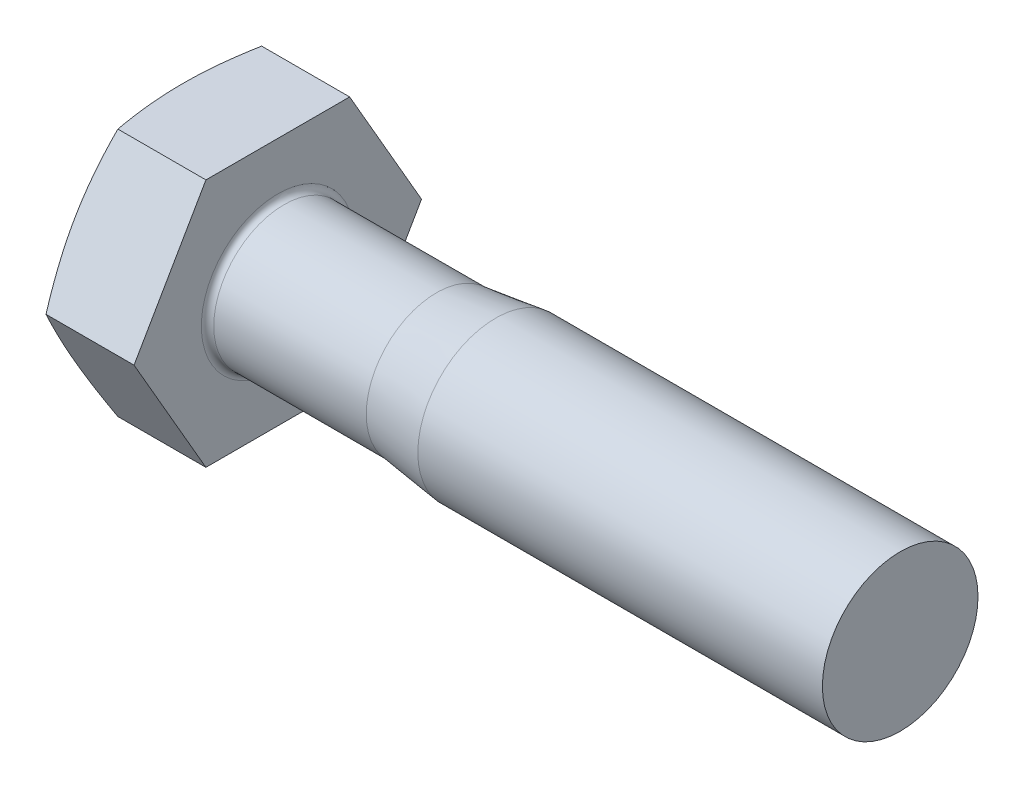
ISO-10303-21;
HEADER;
FILE_DESCRIPTION(('STEP AP214'),'2;1');
FILE_NAME('part.step','',(''),(''),'','','');
FILE_SCHEMA(('AUTOMOTIVE_DESIGN { 1 0 10303 214 1 1 1 1 }'));
ENDSEC;
DATA;
#1=APPLICATION_CONTEXT('core data for automotive mechanical design processes');
#2=APPLICATION_PROTOCOL_DEFINITION('international standard','automotive_design',2000,#1);
#3=PRODUCT_CONTEXT('',#1,'mechanical');
#4=PRODUCT('Part','Part','',(#3));
#5=PRODUCT_RELATED_PRODUCT_CATEGORY('part','',(#4));
#6=PRODUCT_DEFINITION_FORMATION('','',#4);
#7=PRODUCT_DEFINITION_CONTEXT('part definition',#1,'design');
#8=PRODUCT_DEFINITION('design','',#6,#7);
#9=PRODUCT_DEFINITION_SHAPE('','',#8);
#10=(LENGTH_UNIT() NAMED_UNIT(*) SI_UNIT(.MILLI.,.METRE.));
#11=(NAMED_UNIT(*) PLANE_ANGLE_UNIT() SI_UNIT($,.RADIAN.));
#12=(NAMED_UNIT(*) SI_UNIT($,.STERADIAN.) SOLID_ANGLE_UNIT());
#13=UNCERTAINTY_MEASURE_WITH_UNIT(LENGTH_MEASURE(1.E-05),#10,'distance_accuracy_value','');
#14=(GEOMETRIC_REPRESENTATION_CONTEXT(3) GLOBAL_UNCERTAINTY_ASSIGNED_CONTEXT((#13)) GLOBAL_UNIT_ASSIGNED_CONTEXT((#10,
#11,#12)) REPRESENTATION_CONTEXT('',''));
#15=CARTESIAN_POINT('',(0.,0.,0.));
#16=DIRECTION('',(0.,0.,1.));
#17=DIRECTION('',(1.,0.,0.));
#18=AXIS2_PLACEMENT_3D('',#15,#16,#17);
#19=CARTESIAN_POINT('',(6.4,-8.,-4.61880215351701));
#20=DIRECTION('',(0.,0.5,0.866025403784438));
#21=DIRECTION('',(0.,-0.866025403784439,0.5));
#22=AXIS2_PLACEMENT_3D('',#19,#20,#21);
#23=PLANE('',#22);
#24=CARTESIAN_POINT('',(0.741669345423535,0.000199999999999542,-9.23771977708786));
#25=CARTESIAN_POINT('',(0.672022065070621,-0.331114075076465,-9.04643550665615));
#26=CARTESIAN_POINT('',(0.608665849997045,-0.663520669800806,-8.85452046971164));
#27=CARTESIAN_POINT('',(0.497200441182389,-1.33049516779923,-8.46944256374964));
#28=CARTESIAN_POINT('',(0.449103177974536,-1.66506455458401,-8.27627883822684));
#29=CARTESIAN_POINT('',(0.371307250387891,-2.33265174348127,-7.89084719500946));
#30=CARTESIAN_POINT('',(0.341438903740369,-2.66565429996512,-7.69858807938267));
#31=CARTESIAN_POINT('',(0.301377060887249,-3.33243813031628,-7.31362025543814));
#32=CARTESIAN_POINT('',(0.291176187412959,-3.66621906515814,-7.12091174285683));
#33=CARTESIAN_POINT('',(0.291176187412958,-4.33378093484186,-6.73549471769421));
#34=CARTESIAN_POINT('',(0.301377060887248,-4.66756186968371,-6.54278620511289));
#35=CARTESIAN_POINT('',(0.341438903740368,-5.33434570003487,-6.15781838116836));
#36=CARTESIAN_POINT('',(0.37130725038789,-5.66734825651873,-5.96555926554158));
#37=CARTESIAN_POINT('',(0.449103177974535,-6.33493544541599,-5.5801276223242));
#38=CARTESIAN_POINT('',(0.497200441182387,-6.66950483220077,-5.38696389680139));
#39=CARTESIAN_POINT('',(0.608665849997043,-7.33647933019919,-5.00188599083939));
#40=CARTESIAN_POINT('',(0.672022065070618,-7.66888592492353,-4.80997095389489));
#41=CARTESIAN_POINT('',(0.741669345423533,-8.0002,-4.61868668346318));
#42=B_SPLINE_CURVE_WITH_KNOTS('',3,(#24,#25,#26,#27,#28,#29,#30,#31,#32,#33,#34,#35,#36,#37,#38,
#39,#40,#41),.UNSPECIFIED.,.F.,.F.,(4,2,2,2,2,2,2,2,4),(0.,1.16669003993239,2.33429004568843,
3.4908488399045,4.6469737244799,5.8030986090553,6.95965740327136,8.12725740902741,
9.2939474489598),.UNSPECIFIED.);
#43=CARTESIAN_POINT('',(0.74162731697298,0.,-9.23760430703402));
#44=VERTEX_POINT('',#43);
#45=CARTESIAN_POINT('',(0.741627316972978,-8.,-4.61880215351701));
#46=VERTEX_POINT('',#45);
#47=EDGE_CURVE('E47',#44,#46,#42,.T.);
#48=ORIENTED_EDGE('',*,*,#47,.F.);
#49=DIRECTION('',(-1.,0.,0.));
#50=VECTOR('',#49,1.);
#51=CARTESIAN_POINT('',(6.4,0.,-9.23760430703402));
#52=LINE('',#51,#50);
#53=CARTESIAN_POINT('',(6.4,0.,-9.23760430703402));
#54=VERTEX_POINT('',#53);
#55=EDGE_CURVE('E117',#54,#44,#52,.T.);
#56=ORIENTED_EDGE('',*,*,#55,.F.);
#57=DIRECTION('',(0.,0.866025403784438,-0.5));
#58=VECTOR('',#57,1.);
#59=CARTESIAN_POINT('',(6.4,-8.,-4.61880215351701));
#60=LINE('',#59,#58);
#61=CARTESIAN_POINT('',(6.4,-8.,-4.61880215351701));
#62=VERTEX_POINT('',#61);
#63=EDGE_CURVE('E157',#62,#54,#60,.T.);
#64=ORIENTED_EDGE('',*,*,#63,.F.);
#65=DIRECTION('',(-1.,0.,0.));
#66=VECTOR('',#65,1.);
#67=CARTESIAN_POINT('',(6.4,-8.,-4.61880215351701));
#68=LINE('',#67,#66);
#69=EDGE_CURVE('E111',#62,#46,#68,.T.);
#70=ORIENTED_EDGE('',*,*,#69,.T.);
#71=EDGE_LOOP('',(#48,#56,#64,#70));
#72=FACE_BOUND('',#71,.T.);
#73=ADVANCED_FACE('F32',(#72),#23,.F.);
#74=CARTESIAN_POINT('',(6.4,0.,-9.23760430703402));
#75=DIRECTION('',(0.,-0.5,0.866025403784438));
#76=DIRECTION('',(0.,-0.866025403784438,-0.5));
#77=AXIS2_PLACEMENT_3D('',#74,#75,#76);
#78=PLANE('',#77);
#79=CARTESIAN_POINT('',(0.741669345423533,8.0002,-4.61868668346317));
#80=CARTESIAN_POINT('',(0.672022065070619,7.66888592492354,-4.80997095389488));
#81=CARTESIAN_POINT('',(0.608665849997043,7.33647933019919,-5.00188599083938));
#82=CARTESIAN_POINT('',(0.497200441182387,6.66950483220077,-5.38696389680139));
#83=CARTESIAN_POINT('',(0.449103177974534,6.33493544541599,-5.58012762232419));
#84=CARTESIAN_POINT('',(0.371307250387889,5.66734825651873,-5.96555926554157));
#85=CARTESIAN_POINT('',(0.341438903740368,5.33434570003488,-6.15781838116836));
#86=CARTESIAN_POINT('',(0.301377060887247,4.66756186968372,-6.54278620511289));
#87=CARTESIAN_POINT('',(0.291176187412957,4.33378093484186,-6.7354947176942));
#88=CARTESIAN_POINT('',(0.291176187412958,3.66621906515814,-7.12091174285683));
#89=CARTESIAN_POINT('',(0.301377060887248,3.33243813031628,-7.31362025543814));
#90=CARTESIAN_POINT('',(0.341438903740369,2.66565429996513,-7.69858807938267));
#91=CARTESIAN_POINT('',(0.37130725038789,2.33265174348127,-7.89084719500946));
#92=CARTESIAN_POINT('',(0.449103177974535,1.66506455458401,-8.27627883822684));
#93=CARTESIAN_POINT('',(0.497200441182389,1.33049516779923,-8.46944256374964));
#94=CARTESIAN_POINT('',(0.608665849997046,0.663520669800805,-8.85452046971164));
#95=CARTESIAN_POINT('',(0.672022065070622,0.331114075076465,-9.04643550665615));
#96=CARTESIAN_POINT('',(0.741669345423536,-0.000200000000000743,-9.23771977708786));
#97=B_SPLINE_CURVE_WITH_KNOTS('',3,(#79,#80,#81,#82,#83,#84,#85,#86,#87,#88,#89,#90,#91,#92,#93,
#94,#95,#96),.UNSPECIFIED.,.F.,.F.,(4,2,2,2,2,2,2,2,4),(0.,1.16669003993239,2.33429004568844,
3.4908488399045,4.6469737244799,5.80309860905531,6.95965740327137,8.12725740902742,
9.29394744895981),.UNSPECIFIED.);
#98=CARTESIAN_POINT('',(0.741627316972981,8.,-4.61880215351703));
#99=VERTEX_POINT('',#98);
#100=EDGE_CURVE('E149',#99,#44,#97,.T.);
#101=ORIENTED_EDGE('',*,*,#100,.F.);
#102=DIRECTION('',(-1.,0.,0.));
#103=VECTOR('',#102,1.);
#104=CARTESIAN_POINT('',(6.4,8.,-4.61880215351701));
#105=LINE('',#104,#103);
#106=CARTESIAN_POINT('',(6.4,8.,-4.61880215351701));
#107=VERTEX_POINT('',#106);
#108=EDGE_CURVE('E109',#107,#99,#105,.T.);
#109=ORIENTED_EDGE('',*,*,#108,.F.);
#110=DIRECTION('',(0.,0.866025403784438,0.5));
#111=VECTOR('',#110,1.);
#112=CARTESIAN_POINT('',(6.4,0.,-9.23760430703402));
#113=LINE('',#112,#111);
#114=EDGE_CURVE('E154',#54,#107,#113,.T.);
#115=ORIENTED_EDGE('',*,*,#114,.F.);
#116=ORIENTED_EDGE('',*,*,#55,.T.);
#117=EDGE_LOOP('',(#101,#109,#115,#116));
#118=FACE_BOUND('',#117,.T.);
#119=ADVANCED_FACE('F138',(#118),#78,.F.);
#120=CARTESIAN_POINT('',(6.4,8.,-4.61880215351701));
#121=DIRECTION('',(0.,-1.,0.));
#122=DIRECTION('',(0.,0.,-1.));
#123=AXIS2_PLACEMENT_3D('',#120,#121,#122);
#124=PLANE('',#123);
#125=CARTESIAN_POINT('',(2.68976892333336,8.,-12.2012465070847));
#126=CARTESIAN_POINT('',(2.57971664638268,8.,-11.8395797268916));
#127=CARTESIAN_POINT('',(2.47095469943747,8.,-11.4775129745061));
#128=CARTESIAN_POINT('',(2.25672537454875,8.,-10.7523759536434));
#129=CARTESIAN_POINT('',(2.15125825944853,8.,-10.3893056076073));
#130=CARTESIAN_POINT('',(1.94415537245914,8.,-9.66133032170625));
#131=CARTESIAN_POINT('',(1.84252719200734,8.,-9.29642321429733));
#132=CARTESIAN_POINT('',(1.64429920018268,8.,-8.56524765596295));
#133=CARTESIAN_POINT('',(1.54769929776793,8.,-8.19897922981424));
#134=CARTESIAN_POINT('',(1.36193890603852,8.,-7.46941725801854));
#135=CARTESIAN_POINT('',(1.27270063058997,8.,-7.10614361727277));
#136=CARTESIAN_POINT('',(1.10186352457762,8.,-6.37778553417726));
#137=CARTESIAN_POINT('',(1.02026482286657,8.,-6.01270106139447));
#138=CARTESIAN_POINT('',(0.866618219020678,8.,-5.2806446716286));
#139=CARTESIAN_POINT('',(0.794566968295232,8.,-4.91367346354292));
#140=CARTESIAN_POINT('',(0.662216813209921,8.,-4.17760203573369));
#141=CARTESIAN_POINT('',(0.60191751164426,8.,-3.80850188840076));
#142=CARTESIAN_POINT('',(0.501500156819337,8.,-3.10978401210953));
#143=CARTESIAN_POINT('',(0.459876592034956,8.,-2.78038468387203));
#144=CARTESIAN_POINT('',(0.389510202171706,8.,-2.12020164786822));
#145=CARTESIAN_POINT('',(0.360767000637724,8.,-1.78941798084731));
#146=CARTESIAN_POINT('',(0.317545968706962,8.,-1.12713777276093));
#147=CARTESIAN_POINT('',(0.303058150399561,8.,-0.795641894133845));
#148=CARTESIAN_POINT('',(0.289080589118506,8.,-0.132330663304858));
#149=CARTESIAN_POINT('',(0.289590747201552,8.,0.199484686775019));
#150=CARTESIAN_POINT('',(0.305622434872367,8.,0.864453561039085));
#151=CARTESIAN_POINT('',(0.321221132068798,8.,1.19760519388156));
#152=CARTESIAN_POINT('',(0.366713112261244,8.,1.86292258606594));
#153=CARTESIAN_POINT('',(0.39660673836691,8.,2.19508832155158));
#154=CARTESIAN_POINT('',(0.469296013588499,8.,2.85827300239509));
#155=CARTESIAN_POINT('',(0.512102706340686,8.,3.18929071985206));
#156=CARTESIAN_POINT('',(0.608889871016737,8.,3.84966990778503));
#157=CARTESIAN_POINT('',(0.662870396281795,8.,4.17903137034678));
#158=CARTESIAN_POINT('',(0.783783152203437,8.,4.85578954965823));
#159=CARTESIAN_POINT('',(0.85129861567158,8.,5.2030811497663));
#160=CARTESIAN_POINT('',(0.995020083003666,8.,5.89587297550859));
#161=CARTESIAN_POINT('',(1.07122675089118,8.,6.24137306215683));
#162=CARTESIAN_POINT('',(1.23072133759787,8.,6.93083211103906));
#163=CARTESIAN_POINT('',(1.31401133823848,8.,7.27479058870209));
#164=CARTESIAN_POINT('',(1.48631199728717,8.,7.96125577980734));
#165=CARTESIAN_POINT('',(1.57532251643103,8.,8.30376252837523));
#166=CARTESIAN_POINT('',(1.75810796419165,8.,8.98797246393));
#167=CARTESIAN_POINT('',(1.85188890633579,8.,9.32967403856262));
#168=CARTESIAN_POINT('',(2.04325051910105,8.,10.0120101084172));
#169=CARTESIAN_POINT('',(2.14083120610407,8.,10.3526445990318));
#170=CARTESIAN_POINT('',(2.33909251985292,8.,11.0329439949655));
#171=CARTESIAN_POINT('',(2.43977260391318,8.,11.3726090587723));
#172=CARTESIAN_POINT('',(2.64371294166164,8.,12.0511645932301));
#173=CARTESIAN_POINT('',(2.7469732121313,8.,12.3900550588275));
#174=CARTESIAN_POINT('',(3.05757662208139,8.,13.3980187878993));
#175=CARTESIAN_POINT('',(3.2680247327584,8.,14.0661350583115));
#176=CARTESIAN_POINT('',(3.69484331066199,8.,15.4004993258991));
#177=CARTESIAN_POINT('',(3.91121406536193,8.,16.0667472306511));
#178=CARTESIAN_POINT('',(4.34746385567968,8.,17.3952834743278));
#179=CARTESIAN_POINT('',(4.56732640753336,8.,18.0575772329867));
#180=CARTESIAN_POINT('',(4.89953990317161,8.,19.0501761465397));
#181=CARTESIAN_POINT('',(5.01067647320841,8.,19.3808888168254));
#182=CARTESIAN_POINT('',(5.23366301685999,8.,20.0420727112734));
#183=CARTESIAN_POINT('',(5.34551298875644,8.,20.372543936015));
#184=CARTESIAN_POINT('',(5.45767192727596,8.,20.7029103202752));
#185=B_SPLINE_CURVE_WITH_KNOTS('',3,(#125,#126,#127,#128,#129,#130,#131,#132,#133,#134,#135,
#136,#137,#138,#139,#140,#141,#142,#143,#144,#145,#146,#147,#148,#149,#150,#151,#152,#153,#154,
#155,#156,#157,#158,#159,#160,#161,#162,#163,#164,#165,#166,#167,#168,#169,#170,#171,#172,#173,
#174,#175,#176,#177,#178,#179,#180,#181,#182,#183,#184),.UNSPECIFIED.,.F.,.F.,(4,2,2,2,2,2,2,2,
2,2,2,2,2,2,2,2,2,2,2,2,2,2,2,2,2,2,2,2,2,4),(0.,1.13412858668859,2.26834741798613,
3.40470280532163,4.54103761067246,5.66319372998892,6.78536877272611,7.9071491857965,
9.02889167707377,10.0247284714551,11.0205361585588,12.015645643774,13.0107485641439,
14.0109678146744,15.011211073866,16.0123122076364,17.0134181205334,18.0746616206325,
19.1359862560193,20.1976239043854,21.2592357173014,22.3222206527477,23.3852101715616,
24.4480146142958,25.5108259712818,27.6122114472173,29.7136991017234,31.8071897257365,
32.8538504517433,33.9005086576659),.UNSPECIFIED.);
#186=CARTESIAN_POINT('',(0.741627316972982,8.00000000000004,4.61880215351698));
#187=VERTEX_POINT('',#186);
#188=EDGE_CURVE('E103',#187,#99,#185,.F.);
#189=ORIENTED_EDGE('',*,*,#188,.F.);
#190=DIRECTION('',(-1.,0.,0.));
#191=VECTOR('',#190,1.);
#192=CARTESIAN_POINT('',(6.4,8.,4.618802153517));
#193=LINE('',#192,#191);
#194=CARTESIAN_POINT('',(6.4,8.,4.618802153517));
#195=VERTEX_POINT('',#194);
#196=EDGE_CURVE('E102',#195,#187,#193,.T.);
#197=ORIENTED_EDGE('',*,*,#196,.F.);
#198=DIRECTION('',(0.,0.,1.));
#199=VECTOR('',#198,1.);
#200=CARTESIAN_POINT('',(6.4,8.,-4.61880215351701));
#201=LINE('',#200,#199);
#202=EDGE_CURVE('E156',#107,#195,#201,.T.);
#203=ORIENTED_EDGE('',*,*,#202,.F.);
#204=ORIENTED_EDGE('',*,*,#108,.T.);
#205=EDGE_LOOP('',(#189,#197,#203,#204));
#206=FACE_BOUND('',#205,.T.);
#207=ADVANCED_FACE('F143',(#206),#124,.F.);
#208=CARTESIAN_POINT('',(6.4,8.,4.618802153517));
#209=DIRECTION('',(0.,-0.5,-0.866025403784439));
#210=DIRECTION('',(0.,0.866025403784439,-0.5));
#211=AXIS2_PLACEMENT_3D('',#208,#209,#210);
#212=PLANE('',#211);
#213=CARTESIAN_POINT('',(0.741669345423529,-0.000199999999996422,9.23771977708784));
#214=CARTESIAN_POINT('',(0.672022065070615,0.33111407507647,9.04643550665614));
#215=CARTESIAN_POINT('',(0.608665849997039,0.66352066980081,8.85452046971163));
#216=CARTESIAN_POINT('',(0.497200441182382,1.33049516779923,8.46944256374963));
#217=CARTESIAN_POINT('',(0.44910317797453,1.66506455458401,8.27627883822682));
#218=CARTESIAN_POINT('',(0.371307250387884,2.33265174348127,7.89084719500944));
#219=CARTESIAN_POINT('',(0.341438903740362,2.66565429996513,7.69858807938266));
#220=CARTESIAN_POINT('',(0.301377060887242,3.33243813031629,7.31362025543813));
#221=CARTESIAN_POINT('',(0.291176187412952,3.66621906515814,7.12091174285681));
#222=CARTESIAN_POINT('',(0.291176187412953,4.33378093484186,6.73549471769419));
#223=CARTESIAN_POINT('',(0.301377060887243,4.66756186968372,6.54278620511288));
#224=CARTESIAN_POINT('',(0.341438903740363,5.33434570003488,6.15781838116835));
#225=CARTESIAN_POINT('',(0.371307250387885,5.66734825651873,5.96555926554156));
#226=CARTESIAN_POINT('',(0.449103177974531,6.33493544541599,5.58012762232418));
#227=CARTESIAN_POINT('',(0.497200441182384,6.66950483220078,5.38696389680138));
#228=CARTESIAN_POINT('',(0.608665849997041,7.3364793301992,5.00188599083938));
#229=CARTESIAN_POINT('',(0.672022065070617,7.66888592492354,4.80997095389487));
#230=CARTESIAN_POINT('',(0.741669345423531,8.0002,4.61868668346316));
#231=B_SPLINE_CURVE_WITH_KNOTS('',3,(#213,#214,#215,#216,#217,#218,#219,#220,#221,#222,#223,
#224,#225,#226,#227,#228,#229,#230),.UNSPECIFIED.,.F.,.F.,(4,2,2,2,2,2,2,2,4),(0.,
1.16669003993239,2.33429004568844,3.4908488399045,4.6469737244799,5.80309860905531,
6.95965740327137,8.12725740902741,9.2939474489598),.UNSPECIFIED.);
#232=CARTESIAN_POINT('',(0.741627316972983,0.,9.23760430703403));
#233=VERTEX_POINT('',#232);
#234=EDGE_CURVE('E86',#233,#187,#231,.T.);
#235=ORIENTED_EDGE('',*,*,#234,.F.);
#236=DIRECTION('',(-1.,0.,0.));
#237=VECTOR('',#236,1.);
#238=CARTESIAN_POINT('',(6.4,0.,9.23760430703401));
#239=LINE('',#238,#237);
#240=CARTESIAN_POINT('',(6.4,0.,9.23760430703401));
#241=VERTEX_POINT('',#240);
#242=EDGE_CURVE('E99',#241,#233,#239,.T.);
#243=ORIENTED_EDGE('',*,*,#242,.F.);
#244=DIRECTION('',(0.,-0.866025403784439,0.5));
#245=VECTOR('',#244,1.);
#246=CARTESIAN_POINT('',(6.4,8.,4.618802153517));
#247=LINE('',#246,#245);
#248=EDGE_CURVE('E159',#195,#241,#247,.T.);
#249=ORIENTED_EDGE('',*,*,#248,.F.);
#250=ORIENTED_EDGE('',*,*,#196,.T.);
#251=EDGE_LOOP('',(#235,#243,#249,#250));
#252=FACE_BOUND('',#251,.T.);
#253=ADVANCED_FACE('F97',(#252),#212,.F.);
#254=CARTESIAN_POINT('',(6.4,0.,9.23760430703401));
#255=DIRECTION('',(0.,0.5,-0.866025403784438));
#256=DIRECTION('',(0.,0.866025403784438,0.5));
#257=AXIS2_PLACEMENT_3D('',#254,#255,#256);
#258=PLANE('',#257);
#259=CARTESIAN_POINT('',(0.741669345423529,-8.0002,4.61868668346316));
#260=CARTESIAN_POINT('',(0.672022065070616,-7.66888592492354,4.80997095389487));
#261=CARTESIAN_POINT('',(0.60866584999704,-7.33647933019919,5.00188599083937));
#262=CARTESIAN_POINT('',(0.497200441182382,-6.66950483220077,5.38696389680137));
#263=CARTESIAN_POINT('',(0.449103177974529,-6.33493544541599,5.58012762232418));
#264=CARTESIAN_POINT('',(0.371307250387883,-5.66734825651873,5.96555926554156));
#265=CARTESIAN_POINT('',(0.341438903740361,-5.33434570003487,6.15781838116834));
#266=CARTESIAN_POINT('',(0.30137706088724,-4.66756186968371,6.54278620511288));
#267=CARTESIAN_POINT('',(0.291176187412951,-4.33378093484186,6.73549471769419));
#268=CARTESIAN_POINT('',(0.291176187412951,-3.66621906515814,7.12091174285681));
#269=CARTESIAN_POINT('',(0.30137706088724,-3.33243813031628,7.31362025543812));
#270=CARTESIAN_POINT('',(0.341438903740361,-2.66565429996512,7.69858807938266));
#271=CARTESIAN_POINT('',(0.371307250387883,-2.33265174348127,7.89084719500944));
#272=CARTESIAN_POINT('',(0.449103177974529,-1.66506455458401,8.27627883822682));
#273=CARTESIAN_POINT('',(0.497200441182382,-1.33049516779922,8.46944256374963));
#274=CARTESIAN_POINT('',(0.60866584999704,-0.663520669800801,8.85452046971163));
#275=CARTESIAN_POINT('',(0.672022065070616,-0.33111407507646,9.04643550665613));
#276=CARTESIAN_POINT('',(0.741669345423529,0.000200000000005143,9.23771977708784));
#277=B_SPLINE_CURVE_WITH_KNOTS('',3,(#259,#260,#261,#262,#263,#264,#265,#266,#267,#268,#269,
#270,#271,#272,#273,#274,#275,#276),.UNSPECIFIED.,.F.,.F.,(4,2,2,2,2,2,2,2,4),(0.,
1.16669003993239,2.33429004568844,3.4908488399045,4.64697372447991,5.80309860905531,
6.95965740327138,8.12725740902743,9.29394744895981),.UNSPECIFIED.);
#278=CARTESIAN_POINT('',(0.741627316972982,-8.,4.61880215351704));
#279=VERTEX_POINT('',#278);
#280=EDGE_CURVE('E83',#279,#233,#277,.T.);
#281=ORIENTED_EDGE('',*,*,#280,.F.);
#282=DIRECTION('',(-1.,0.,0.));
#283=VECTOR('',#282,1.);
#284=CARTESIAN_POINT('',(6.4,-8.,4.61880215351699));
#285=LINE('',#284,#283);
#286=CARTESIAN_POINT('',(6.4,-8.,4.61880215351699));
#287=VERTEX_POINT('',#286);
#288=EDGE_CURVE('E107',#287,#279,#285,.T.);
#289=ORIENTED_EDGE('',*,*,#288,.F.);
#290=DIRECTION('',(0.,-0.866025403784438,-0.5));
#291=VECTOR('',#290,1.);
#292=CARTESIAN_POINT('',(6.4,0.,9.23760430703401));
#293=LINE('',#292,#291);
#294=EDGE_CURVE('E106',#241,#287,#293,.T.);
#295=ORIENTED_EDGE('',*,*,#294,.F.);
#296=ORIENTED_EDGE('',*,*,#242,.T.);
#297=EDGE_LOOP('',(#281,#289,#295,#296));
#298=FACE_BOUND('',#297,.T.);
#299=ADVANCED_FACE('F105',(#298),#258,.F.);
#300=CARTESIAN_POINT('',(6.4,-8.,4.61880215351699));
#301=DIRECTION('',(0.,1.,0.));
#302=DIRECTION('',(0.,0.,1.));
#303=AXIS2_PLACEMENT_3D('',#300,#301,#302);
#304=PLANE('',#303);
#305=CARTESIAN_POINT('',(2.68976892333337,-8.,-12.2012465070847));
#306=CARTESIAN_POINT('',(2.57971664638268,-8.,-11.8395797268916));
#307=CARTESIAN_POINT('',(2.47095469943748,-8.,-11.4775129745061));
#308=CARTESIAN_POINT('',(2.25672537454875,-8.,-10.7523759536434));
#309=CARTESIAN_POINT('',(2.15125825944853,-8.,-10.3893056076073));
#310=CARTESIAN_POINT('',(1.94415537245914,-8.,-9.66133032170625));
#311=CARTESIAN_POINT('',(1.84252719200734,-8.,-9.29642321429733));
#312=CARTESIAN_POINT('',(1.64429920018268,-8.,-8.56524765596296));
#313=CARTESIAN_POINT('',(1.54769929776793,-8.,-8.19897922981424));
#314=CARTESIAN_POINT('',(1.36193890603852,-8.,-7.46941725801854));
#315=CARTESIAN_POINT('',(1.27270063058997,-8.,-7.10614361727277));
#316=CARTESIAN_POINT('',(1.10186352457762,-8.,-6.37778553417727));
#317=CARTESIAN_POINT('',(1.02026482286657,-8.,-6.01270106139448));
#318=CARTESIAN_POINT('',(0.866618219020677,-8.,-5.28064467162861));
#319=CARTESIAN_POINT('',(0.794566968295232,-8.,-4.91367346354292));
#320=CARTESIAN_POINT('',(0.662216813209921,-8.,-4.17760203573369));
#321=CARTESIAN_POINT('',(0.60191751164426,-8.,-3.80850188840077));
#322=CARTESIAN_POINT('',(0.501500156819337,-8.,-3.10978401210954));
#323=CARTESIAN_POINT('',(0.459876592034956,-8.,-2.78038468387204));
#324=CARTESIAN_POINT('',(0.389510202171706,-8.,-2.12020164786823));
#325=CARTESIAN_POINT('',(0.360767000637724,-8.,-1.78941798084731));
#326=CARTESIAN_POINT('',(0.317545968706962,-8.,-1.12713777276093));
#327=CARTESIAN_POINT('',(0.303058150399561,-8.,-0.79564189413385));
#328=CARTESIAN_POINT('',(0.289080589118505,-8.,-0.132330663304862));
#329=CARTESIAN_POINT('',(0.289590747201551,-8.,0.199484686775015));
#330=CARTESIAN_POINT('',(0.305622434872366,-8.,0.864453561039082));
#331=CARTESIAN_POINT('',(0.321221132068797,-8.,1.19760519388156));
#332=CARTESIAN_POINT('',(0.366713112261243,-8.,1.86292258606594));
#333=CARTESIAN_POINT('',(0.396606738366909,-8.,2.19508832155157));
#334=CARTESIAN_POINT('',(0.469296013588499,-8.,2.85827300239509));
#335=CARTESIAN_POINT('',(0.512102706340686,-8.,3.18929071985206));
#336=CARTESIAN_POINT('',(0.608889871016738,-8.,3.84966990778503));
#337=CARTESIAN_POINT('',(0.662870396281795,-8.,4.17903137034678));
#338=CARTESIAN_POINT('',(0.783783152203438,-8.,4.85578954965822));
#339=CARTESIAN_POINT('',(0.851298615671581,-8.,5.20308114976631));
#340=CARTESIAN_POINT('',(0.995020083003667,-8.,5.89587297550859));
#341=CARTESIAN_POINT('',(1.07122675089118,-8.,6.24137306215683));
#342=CARTESIAN_POINT('',(1.23072133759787,-8.,6.93083211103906));
#343=CARTESIAN_POINT('',(1.31401133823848,-8.,7.27479058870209));
#344=CARTESIAN_POINT('',(1.48631199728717,-8.,7.96125577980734));
#345=CARTESIAN_POINT('',(1.57532251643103,-8.,8.30376252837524));
#346=CARTESIAN_POINT('',(1.75810796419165,-8.,8.98797246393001));
#347=CARTESIAN_POINT('',(1.85188890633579,-8.,9.32967403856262));
#348=CARTESIAN_POINT('',(2.04325051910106,-8.,10.0120101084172));
#349=CARTESIAN_POINT('',(2.14083120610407,-8.,10.3526445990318));
#350=CARTESIAN_POINT('',(2.33909251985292,-8.,11.0329439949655));
#351=CARTESIAN_POINT('',(2.43977260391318,-8.,11.3726090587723));
#352=CARTESIAN_POINT('',(2.64371294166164,-8.,12.0511645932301));
#353=CARTESIAN_POINT('',(2.7469732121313,-8.,12.3900550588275));
#354=CARTESIAN_POINT('',(3.05757662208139,-8.,13.3980187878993));
#355=CARTESIAN_POINT('',(3.2680247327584,-8.,14.0661350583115));
#356=CARTESIAN_POINT('',(3.69484331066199,-8.,15.4004993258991));
#357=CARTESIAN_POINT('',(3.91121406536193,-8.,16.0667472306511));
#358=CARTESIAN_POINT('',(4.34746385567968,-8.,17.3952834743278));
#359=CARTESIAN_POINT('',(4.56732640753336,-8.,18.0575772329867));
#360=CARTESIAN_POINT('',(4.89953990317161,-8.,19.0501761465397));
#361=CARTESIAN_POINT('',(5.01067647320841,-8.,19.3808888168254));
#362=CARTESIAN_POINT('',(5.23366301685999,-8.,20.0420727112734));
#363=CARTESIAN_POINT('',(5.34551298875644,-8.,20.372543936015));
#364=CARTESIAN_POINT('',(5.45767192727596,-8.,20.7029103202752));
#365=B_SPLINE_CURVE_WITH_KNOTS('',3,(#305,#306,#307,#308,#309,#310,#311,#312,#313,#314,#315,
#316,#317,#318,#319,#320,#321,#322,#323,#324,#325,#326,#327,#328,#329,#330,#331,#332,#333,#334,
#335,#336,#337,#338,#339,#340,#341,#342,#343,#344,#345,#346,#347,#348,#349,#350,#351,#352,#353,
#354,#355,#356,#357,#358,#359,#360,#361,#362,#363,#364),.UNSPECIFIED.,.F.,.F.,(4,2,2,2,2,2,2,2,
2,2,2,2,2,2,2,2,2,2,2,2,2,2,2,2,2,2,2,2,2,4),(0.,1.13412858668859,2.26834741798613,
3.40470280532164,4.54103761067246,5.66319372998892,6.78536877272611,7.9071491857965,
9.02889167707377,10.0247284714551,11.0205361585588,12.015645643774,13.0107485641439,
14.0109678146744,15.011211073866,16.0123122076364,17.0134181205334,18.0746616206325,
19.1359862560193,20.1976239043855,21.2592357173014,22.3222206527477,23.3852101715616,
24.4480146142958,25.5108259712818,27.6122114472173,29.7136991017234,31.8071897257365,
32.8538504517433,33.9005086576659),.UNSPECIFIED.);
#366=EDGE_CURVE('E88',#46,#279,#365,.T.);
#367=ORIENTED_EDGE('',*,*,#366,.F.);
#368=ORIENTED_EDGE('',*,*,#69,.F.);
#369=DIRECTION('',(0.,0.,-1.));
#370=VECTOR('',#369,1.);
#371=CARTESIAN_POINT('',(6.4,-8.,4.61880215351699));
#372=LINE('',#371,#370);
#373=EDGE_CURVE('E55',#287,#62,#372,.T.);
#374=ORIENTED_EDGE('',*,*,#373,.F.);
#375=ORIENTED_EDGE('',*,*,#288,.T.);
#376=EDGE_LOOP('',(#367,#368,#374,#375));
#377=FACE_BOUND('',#376,.T.);
#378=ADVANCED_FACE('F167',(#377),#304,.F.);
#379=CARTESIAN_POINT('',(6.4,0.,-9.23760430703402));
#380=DIRECTION('',(1.,0.,0.));
#381=DIRECTION('',(0.,0.,-1.));
#382=AXIS2_PLACEMENT_3D('',#379,#380,#381);
#383=PLANE('',#382);
#384=CARTESIAN_POINT('',(6.4,0.,0.));
#385=DIRECTION('',(1.,0.,0.));
#386=DIRECTION('',(0.,0.,-1.));
#387=AXIS2_PLACEMENT_3D('',#384,#385,#386);
#388=CIRCLE('',#387,4.913);
#389=CARTESIAN_POINT('',(6.4,0.,-4.913));
#390=VERTEX_POINT('',#389);
#391=EDGE_CURVE('E40',#390,#390,#388,.F.);
#392=ORIENTED_EDGE('',*,*,#391,.T.);
#393=EDGE_LOOP('',(#392));
#394=FACE_BOUND('',#393,.T.);
#395=ORIENTED_EDGE('',*,*,#373,.T.);
#396=ORIENTED_EDGE('',*,*,#63,.T.);
#397=ORIENTED_EDGE('',*,*,#114,.T.);
#398=ORIENTED_EDGE('',*,*,#202,.T.);
#399=ORIENTED_EDGE('',*,*,#248,.T.);
#400=ORIENTED_EDGE('',*,*,#294,.T.);
#401=EDGE_LOOP('',(#395,#396,#397,#398,#399,#400));
#402=FACE_BOUND('',#401,.T.);
#403=ADVANCED_FACE('F122',(#394,#402),#383,.T.);
#404=CARTESIAN_POINT('',(0.,0.,0.));
#405=DIRECTION('',(1.,0.,0.));
#406=DIRECTION('',(0.,0.,-1.));
#407=AXIS2_PLACEMENT_3D('',#404,#405,#406);
#408=CONICAL_SURFACE('',#407,7.20000000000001,1.22173047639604);
#409=CARTESIAN_POINT('',(0.,0.,0.));
#410=DIRECTION('',(-1.,0.,0.));
#411=DIRECTION('',(0.,0.,1.));
#412=AXIS2_PLACEMENT_3D('',#409,#410,#411);
#413=CIRCLE('',#412,7.20000000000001);
#414=CARTESIAN_POINT('',(0.,0.,7.20000000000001));
#415=VERTEX_POINT('',#414);
#416=EDGE_CURVE('E168',#415,#415,#413,.T.);
#417=ORIENTED_EDGE('',*,*,#416,.F.);
#418=EDGE_LOOP('',(#417));
#419=FACE_BOUND('',#418,.T.);
#420=ORIENTED_EDGE('',*,*,#47,.T.);
#421=ORIENTED_EDGE('',*,*,#366,.T.);
#422=ORIENTED_EDGE('',*,*,#280,.T.);
#423=ORIENTED_EDGE('',*,*,#234,.T.);
#424=ORIENTED_EDGE('',*,*,#188,.T.);
#425=ORIENTED_EDGE('',*,*,#100,.T.);
#426=EDGE_LOOP('',(#420,#421,#422,#423,#424,#425));
#427=FACE_BOUND('',#426,.T.);
#428=ADVANCED_FACE('F85',(#419,#427),#408,.T.);
#429=CARTESIAN_POINT('',(0.,0.,-9.23760430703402));
#430=DIRECTION('',(1.,0.,0.));
#431=DIRECTION('',(0.,0.,-1.));
#432=AXIS2_PLACEMENT_3D('',#429,#430,#431);
#433=PLANE('',#432);
#434=CARTESIAN_POINT('',(0.,0.,0.));
#435=DIRECTION('',(-1.,0.,0.));
#436=DIRECTION('',(0.,0.,1.));
#437=AXIS2_PLACEMENT_3D('',#434,#435,#436);
#438=CIRCLE('',#437,5.6);
#439=CARTESIAN_POINT('',(0.,0.,5.6));
#440=VERTEX_POINT('',#439);
#441=EDGE_CURVE('E241',#440,#440,#438,.T.);
#442=ORIENTED_EDGE('',*,*,#441,.F.);
#443=EDGE_LOOP('',(#442));
#444=FACE_BOUND('',#443,.T.);
#445=ORIENTED_EDGE('',*,*,#416,.T.);
#446=EDGE_LOOP('',(#445));
#447=FACE_BOUND('',#446,.T.);
#448=ADVANCED_FACE('F189',(#444,#447),#433,.F.);
#449=CARTESIAN_POINT('',(1.28,0.,0.));
#450=DIRECTION('',(-1.,0.,0.));
#451=DIRECTION('',(0.,0.,1.));
#452=AXIS2_PLACEMENT_3D('',#449,#450,#451);
#453=CYLINDRICAL_SURFACE('',#452,5.6);
#454=CARTESIAN_POINT('',(1.28,0.,0.));
#455=DIRECTION('',(-1.,0.,0.));
#456=DIRECTION('',(0.,0.,1.));
#457=AXIS2_PLACEMENT_3D('',#454,#455,#456);
#458=CIRCLE('',#457,5.6);
#459=CARTESIAN_POINT('',(1.28,0.,5.6));
#460=VERTEX_POINT('',#459);
#461=EDGE_CURVE('E171',#460,#460,#458,.T.);
#462=ORIENTED_EDGE('',*,*,#461,.F.);
#463=EDGE_LOOP('',(#462));
#464=FACE_BOUND('',#463,.T.);
#465=ORIENTED_EDGE('',*,*,#441,.T.);
#466=EDGE_LOOP('',(#465));
#467=FACE_BOUND('',#466,.T.);
#468=ADVANCED_FACE('F191',(#464,#467),#453,.F.);
#469=CARTESIAN_POINT('',(1.28,0.,0.));
#470=DIRECTION('',(-1.,0.,0.));
#471=DIRECTION('',(0.,0.,1.));
#472=AXIS2_PLACEMENT_3D('',#469,#470,#471);
#473=PLANE('',#472);
#474=ORIENTED_EDGE('',*,*,#461,.T.);
#475=EDGE_LOOP('',(#474));
#476=FACE_BOUND('',#475,.T.);
#477=ADVANCED_FACE('F236',(#476),#473,.T.);
#478=CARTESIAN_POINT('',(16.6,0.,0.));
#479=DIRECTION('',(1.,0.,0.));
#480=DIRECTION('',(0.,0.,-1.));
#481=AXIS2_PLACEMENT_3D('',#478,#479,#480);
#482=CONICAL_SURFACE('',#481,4.513,0.127463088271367);
#483=CARTESIAN_POINT('',(20.4,0.,0.));
#484=DIRECTION('',(-1.,0.,0.));
#485=DIRECTION('',(0.,0.,1.));
#486=AXIS2_PLACEMENT_3D('',#483,#484,#485);
#487=CIRCLE('',#486,5.);
#488=CARTESIAN_POINT('',(20.4,0.,5.));
#489=VERTEX_POINT('',#488);
#490=EDGE_CURVE('E244',#489,#489,#487,.T.);
#491=ORIENTED_EDGE('',*,*,#490,.T.);
#492=EDGE_LOOP('',(#491));
#493=FACE_BOUND('',#492,.T.);
#494=CARTESIAN_POINT('',(16.6,0.,0.));
#495=DIRECTION('',(-1.,0.,0.));
#496=DIRECTION('',(0.,0.,1.));
#497=AXIS2_PLACEMENT_3D('',#494,#495,#496);
#498=CIRCLE('',#497,4.513);
#499=CARTESIAN_POINT('',(16.6,0.,4.513));
#500=VERTEX_POINT('',#499);
#501=EDGE_CURVE('E248',#500,#500,#498,.T.);
#502=ORIENTED_EDGE('',*,*,#501,.F.);
#503=EDGE_LOOP('',(#502));
#504=FACE_BOUND('',#503,.T.);
#505=ADVANCED_FACE('F256',(#493,#504),#482,.T.);
#506=CARTESIAN_POINT('',(-2.69717570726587,0.,0.));
#507=DIRECTION('',(-1.,0.,0.));
#508=DIRECTION('',(0.,0.,1.));
#509=AXIS2_PLACEMENT_3D('',#506,#507,#508);
#510=CYLINDRICAL_SURFACE('',#509,4.513);
#511=CARTESIAN_POINT('',(6.8,0.,0.));
#512=DIRECTION('',(1.,0.,0.));
#513=DIRECTION('',(0.,0.,-1.));
#514=AXIS2_PLACEMENT_3D('',#511,#512,#513);
#515=CIRCLE('',#514,4.513);
#516=CARTESIAN_POINT('',(6.8,0.,-4.513));
#517=VERTEX_POINT('',#516);
#518=EDGE_CURVE('E11',#517,#517,#515,.T.);
#519=ORIENTED_EDGE('',*,*,#518,.T.);
#520=EDGE_LOOP('',(#519));
#521=FACE_BOUND('',#520,.T.);
#522=ORIENTED_EDGE('',*,*,#501,.T.);
#523=EDGE_LOOP('',(#522));
#524=FACE_BOUND('',#523,.T.);
#525=ADVANCED_FACE('F254',(#521,#524),#510,.T.);
#526=CARTESIAN_POINT('',(46.4,0.,0.));
#527=DIRECTION('',(1.,0.,0.));
#528=DIRECTION('',(0.,0.,-1.));
#529=AXIS2_PLACEMENT_3D('',#526,#527,#528);
#530=PLANE('',#529);
#531=CARTESIAN_POINT('',(46.4,0.,0.));
#532=DIRECTION('',(1.,0.,0.));
#533=DIRECTION('',(0.,0.,-1.));
#534=AXIS2_PLACEMENT_3D('',#531,#532,#533);
#535=CIRCLE('',#534,5.);
#536=CARTESIAN_POINT('',(46.4,0.,-5.));
#537=VERTEX_POINT('',#536);
#538=EDGE_CURVE('E148',#537,#537,#535,.T.);
#539=ORIENTED_EDGE('',*,*,#538,.T.);
#540=EDGE_LOOP('',(#539));
#541=FACE_BOUND('',#540,.T.);
#542=ADVANCED_FACE('F132',(#541),#530,.T.);
#543=CARTESIAN_POINT('',(46.4,0.,0.));
#544=DIRECTION('',(-1.,0.,0.));
#545=DIRECTION('',(0.,0.,1.));
#546=AXIS2_PLACEMENT_3D('',#543,#544,#545);
#547=CYLINDRICAL_SURFACE('',#546,5.);
#548=ORIENTED_EDGE('',*,*,#538,.F.);
#549=EDGE_LOOP('',(#548));
#550=FACE_BOUND('',#549,.T.);
#551=ORIENTED_EDGE('',*,*,#490,.F.);
#552=EDGE_LOOP('',(#551));
#553=FACE_BOUND('',#552,.T.);
#554=ADVANCED_FACE('F126',(#550,#553),#547,.T.);
#555=CARTESIAN_POINT('',(6.8,0.,0.));
#556=DIRECTION('',(1.,0.,0.));
#557=DIRECTION('',(0.,0.,-1.));
#558=AXIS2_PLACEMENT_3D('',#555,#556,#557);
#559=TOROIDAL_SURFACE('',#558,4.913,0.4);
#560=ORIENTED_EDGE('',*,*,#518,.F.);
#561=EDGE_LOOP('',(#560));
#562=FACE_BOUND('',#561,.T.);
#563=ORIENTED_EDGE('',*,*,#391,.F.);
#564=EDGE_LOOP('',(#563));
#565=FACE_BOUND('',#564,.T.);
#566=ADVANCED_FACE('F124',(#562,#565),#559,.F.);
#567=CLOSED_SHELL('',(#73,#119,#207,#253,#299,#378,#403,#428,#448,#468,#477,#505,#525,#542,#554,#566));
#568=MANIFOLD_SOLID_BREP('B2',#567);
#569=ADVANCED_BREP_SHAPE_REPRESENTATION('',(#18,#568),#14);
#570=SHAPE_DEFINITION_REPRESENTATION(#9,#569);
ENDSEC;
END-ISO-10303-21;
